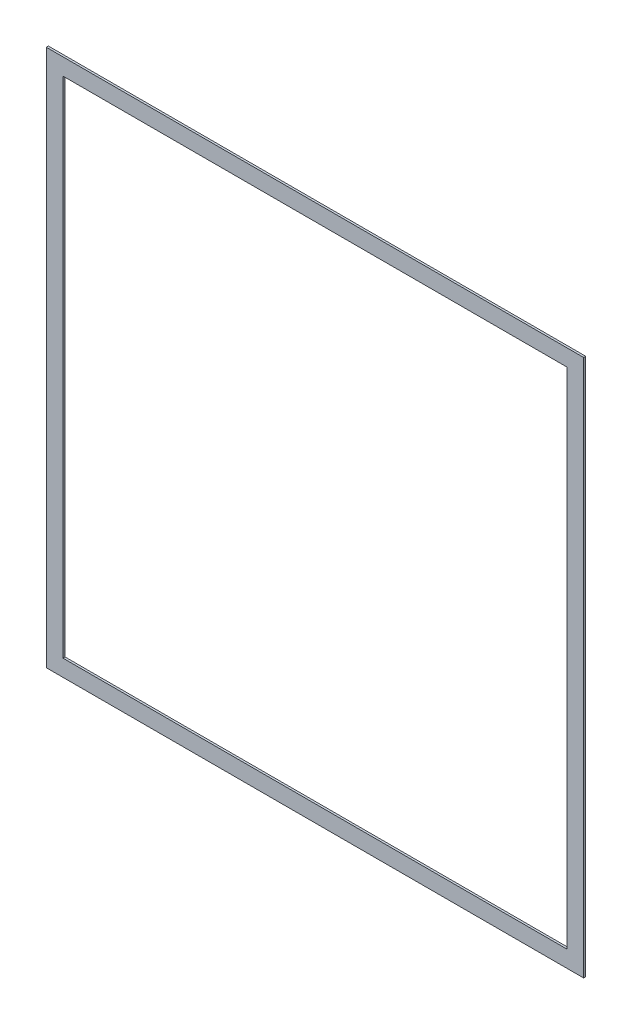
from build123d import *

# Parameters (mm, degrees)
SKETCH1_W      = 819.15
SKETCH1_H      = 819.15
SKETCH1_W_2    = 768.35
SKETCH1_H_2    = 768.35
EXTRUDE1_DEPTH = 1.5875


with BuildPart() as part:
    # Sketch1 → Extrude1 (new, symmetric)
    with BuildSketch(Plane.XY):
        Rectangle(SKETCH1_W, SKETCH1_H)
        Rectangle(SKETCH1_W_2, SKETCH1_H_2, mode=Mode.SUBTRACT)
    extrude(amount=EXTRUDE1_DEPTH, both=True)


solid = part.part
